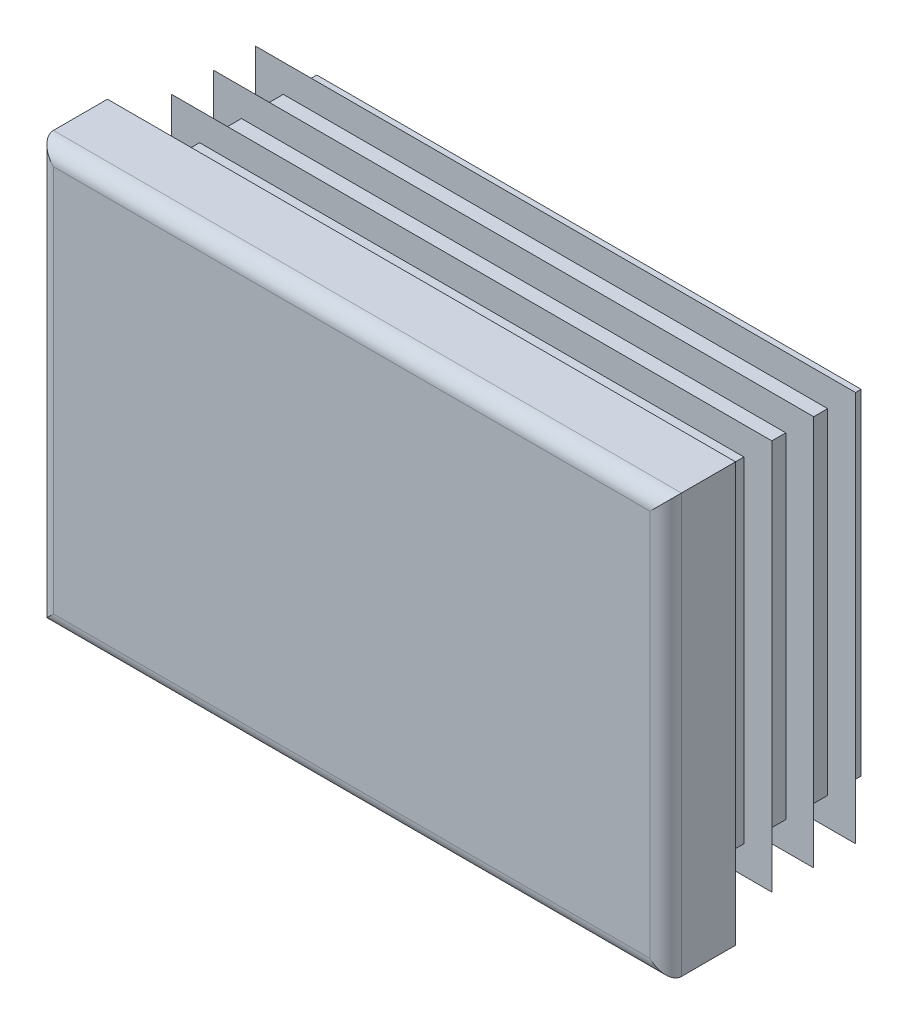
ISO-10303-21;
HEADER;
FILE_DESCRIPTION(('STEP AP214'),'2;1');
FILE_NAME('part.step','',(''),(''),'','','');
FILE_SCHEMA(('AUTOMOTIVE_DESIGN { 1 0 10303 214 1 1 1 1 }'));
ENDSEC;
DATA;
#1=APPLICATION_CONTEXT('core data for automotive mechanical design processes');
#2=APPLICATION_PROTOCOL_DEFINITION('international standard','automotive_design',2000,#1);
#3=PRODUCT_CONTEXT('',#1,'mechanical');
#4=PRODUCT('Part','Part','',(#3));
#5=PRODUCT_RELATED_PRODUCT_CATEGORY('part','',(#4));
#6=PRODUCT_DEFINITION_FORMATION('','',#4);
#7=PRODUCT_DEFINITION_CONTEXT('part definition',#1,'design');
#8=PRODUCT_DEFINITION('design','',#6,#7);
#9=PRODUCT_DEFINITION_SHAPE('','',#8);
#10=(LENGTH_UNIT() NAMED_UNIT(*) SI_UNIT(.MILLI.,.METRE.));
#11=(NAMED_UNIT(*) PLANE_ANGLE_UNIT() SI_UNIT($,.RADIAN.));
#12=(NAMED_UNIT(*) SI_UNIT($,.STERADIAN.) SOLID_ANGLE_UNIT());
#13=UNCERTAINTY_MEASURE_WITH_UNIT(LENGTH_MEASURE(1.E-05),#10,'distance_accuracy_value','');
#14=(GEOMETRIC_REPRESENTATION_CONTEXT(3) GLOBAL_UNCERTAINTY_ASSIGNED_CONTEXT((#13)) GLOBAL_UNIT_ASSIGNED_CONTEXT((#10,
#11,#12)) REPRESENTATION_CONTEXT('',''));
#15=CARTESIAN_POINT('',(0.,0.,0.));
#16=DIRECTION('',(0.,0.,1.));
#17=DIRECTION('',(1.,0.,0.));
#18=AXIS2_PLACEMENT_3D('',#15,#16,#17);
#19=CARTESIAN_POINT('',(21.375,-15.,5.));
#20=DIRECTION('',(0.,0.,-1.));
#21=DIRECTION('',(0.,1.,0.));
#22=AXIS2_PLACEMENT_3D('',#19,#20,#21);
#23=PLANE('',#22);
#24=DIRECTION('',(0.,1.,0.));
#25=VECTOR('',#24,1.);
#26=CARTESIAN_POINT('',(-21.375,-15.,5.));
#27=LINE('',#26,#25);
#28=CARTESIAN_POINT('',(-21.375,-13.875,5.));
#29=VERTEX_POINT('',#28);
#30=CARTESIAN_POINT('',(-21.375,13.875,5.));
#31=VERTEX_POINT('',#30);
#32=EDGE_CURVE('E310',#29,#31,#27,.T.);
#33=ORIENTED_EDGE('',*,*,#32,.F.);
#34=DIRECTION('',(-1.,0.,0.));
#35=VECTOR('',#34,1.);
#36=CARTESIAN_POINT('',(22.5,-13.875,5.));
#37=LINE('',#36,#35);
#38=CARTESIAN_POINT('',(21.375,-13.875,5.));
#39=VERTEX_POINT('',#38);
#40=EDGE_CURVE('E482',#39,#29,#37,.T.);
#41=ORIENTED_EDGE('',*,*,#40,.F.);
#42=DIRECTION('',(0.,1.,0.));
#43=VECTOR('',#42,1.);
#44=CARTESIAN_POINT('',(21.375,-15.,5.));
#45=LINE('',#44,#43);
#46=CARTESIAN_POINT('',(21.375,13.875,5.));
#47=VERTEX_POINT('',#46);
#48=EDGE_CURVE('E305',#39,#47,#45,.T.);
#49=ORIENTED_EDGE('',*,*,#48,.T.);
#50=DIRECTION('',(-1.,0.,0.));
#51=VECTOR('',#50,1.);
#52=CARTESIAN_POINT('',(22.5,13.875,5.));
#53=LINE('',#52,#51);
#54=EDGE_CURVE('E630',#47,#31,#53,.T.);
#55=ORIENTED_EDGE('',*,*,#54,.T.);
#56=EDGE_LOOP('',(#33,#41,#49,#55));
#57=FACE_BOUND('',#56,.T.);
#58=ADVANCED_FACE('F14',(#57),#23,.F.);
#59=CARTESIAN_POINT('',(-21.375,-15.,3.875));
#60=DIRECTION('',(0.,1.,0.));
#61=DIRECTION('',(-1.,0.,0.));
#62=AXIS2_PLACEMENT_3D('',#59,#60,#61);
#63=CYLINDRICAL_SURFACE('',#62,1.125);
#64=DIRECTION('',(0.,1.,0.));
#65=VECTOR('',#64,1.);
#66=CARTESIAN_POINT('',(-22.5,-15.,3.875));
#67=LINE('',#66,#65);
#68=CARTESIAN_POINT('',(-22.5,-15.,3.875));
#69=VERTEX_POINT('',#68);
#70=CARTESIAN_POINT('',(-22.5,15.,3.875));
#71=VERTEX_POINT('',#70);
#72=EDGE_CURVE('E402',#69,#71,#67,.T.);
#73=ORIENTED_EDGE('',*,*,#72,.F.);
#74=CARTESIAN_POINT('',(-21.375,-13.875,3.875));
#75=DIRECTION('',(-0.707106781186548,0.707106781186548,0.));
#76=DIRECTION('',(0.707106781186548,0.707106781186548,0.));
#77=AXIS2_PLACEMENT_3D('',#74,#75,#76);
#78=ELLIPSE('',#77,1.59099025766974,1.125);
#79=EDGE_CURVE('E59',#69,#29,#78,.T.);
#80=ORIENTED_EDGE('',*,*,#79,.T.);
#81=ORIENTED_EDGE('',*,*,#32,.T.);
#82=CARTESIAN_POINT('',(-21.375,13.875,3.875));
#83=DIRECTION('',(0.707106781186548,0.707106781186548,0.));
#84=DIRECTION('',(-0.707106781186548,0.707106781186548,0.));
#85=AXIS2_PLACEMENT_3D('',#82,#83,#84);
#86=ELLIPSE('',#85,1.59099025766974,1.125);
#87=EDGE_CURVE('E306',#31,#71,#86,.F.);
#88=ORIENTED_EDGE('',*,*,#87,.T.);
#89=EDGE_LOOP('',(#73,#80,#81,#88));
#90=FACE_BOUND('',#89,.T.);
#91=ADVANCED_FACE('F16',(#90),#63,.T.);
#92=CARTESIAN_POINT('',(-22.5,-15.,3.875));
#93=DIRECTION('',(1.,0.,0.));
#94=DIRECTION('',(0.,1.,0.));
#95=AXIS2_PLACEMENT_3D('',#92,#93,#94);
#96=PLANE('',#95);
#97=DIRECTION('',(0.,0.,-1.));
#98=VECTOR('',#97,1.);
#99=CARTESIAN_POINT('',(-22.5,15.,3.875));
#100=LINE('',#99,#98);
#101=CARTESIAN_POINT('',(-22.5,15.,0.));
#102=VERTEX_POINT('',#101);
#103=EDGE_CURVE('E615',#71,#102,#100,.T.);
#104=ORIENTED_EDGE('',*,*,#103,.T.);
#105=DIRECTION('',(0.,1.,0.));
#106=VECTOR('',#105,1.);
#107=CARTESIAN_POINT('',(-22.5,-15.,0.));
#108=LINE('',#107,#106);
#109=CARTESIAN_POINT('',(-22.5,-15.,0.));
#110=VERTEX_POINT('',#109);
#111=EDGE_CURVE('E400',#110,#102,#108,.T.);
#112=ORIENTED_EDGE('',*,*,#111,.F.);
#113=DIRECTION('',(0.,0.,-1.));
#114=VECTOR('',#113,1.);
#115=CARTESIAN_POINT('',(-22.5,-15.,3.875));
#116=LINE('',#115,#114);
#117=EDGE_CURVE('E616',#69,#110,#116,.T.);
#118=ORIENTED_EDGE('',*,*,#117,.F.);
#119=ORIENTED_EDGE('',*,*,#72,.T.);
#120=EDGE_LOOP('',(#104,#112,#118,#119));
#121=FACE_BOUND('',#120,.T.);
#122=ADVANCED_FACE('F697',(#121),#96,.F.);
#123=CARTESIAN_POINT('',(-19.5,-15.,0.));
#124=DIRECTION('',(1.,0.,0.));
#125=DIRECTION('',(0.,1.,0.));
#126=AXIS2_PLACEMENT_3D('',#123,#124,#125);
#127=PLANE('',#126);
#128=DIRECTION('',(0.,1.,0.));
#129=VECTOR('',#128,1.);
#130=CARTESIAN_POINT('',(-19.5,-15.,0.));
#131=LINE('',#130,#129);
#132=CARTESIAN_POINT('',(-19.5,-12.,0.));
#133=VERTEX_POINT('',#132);
#134=CARTESIAN_POINT('',(-19.5,12.,0.));
#135=VERTEX_POINT('',#134);
#136=EDGE_CURVE('E397',#133,#135,#131,.T.);
#137=ORIENTED_EDGE('',*,*,#136,.T.);
#138=DIRECTION('',(0.,0.,-1.));
#139=VECTOR('',#138,1.);
#140=CARTESIAN_POINT('',(-19.5,12.,0.));
#141=LINE('',#140,#139);
#142=CARTESIAN_POINT('',(-19.5,12.,-0.6));
#143=VERTEX_POINT('',#142);
#144=EDGE_CURVE('E495',#135,#143,#141,.T.);
#145=ORIENTED_EDGE('',*,*,#144,.T.);
#146=DIRECTION('',(0.,1.,0.));
#147=VECTOR('',#146,1.);
#148=CARTESIAN_POINT('',(-19.5,-15.,-0.6));
#149=LINE('',#148,#147);
#150=CARTESIAN_POINT('',(-19.5,-12.,-0.6));
#151=VERTEX_POINT('',#150);
#152=EDGE_CURVE('E394',#151,#143,#149,.T.);
#153=ORIENTED_EDGE('',*,*,#152,.F.);
#154=DIRECTION('',(0.,0.,1.));
#155=VECTOR('',#154,1.);
#156=CARTESIAN_POINT('',(-19.5,-12.,0.));
#157=LINE('',#156,#155);
#158=EDGE_CURVE('E489',#151,#133,#157,.T.);
#159=ORIENTED_EDGE('',*,*,#158,.T.);
#160=EDGE_LOOP('',(#137,#145,#153,#159));
#161=FACE_BOUND('',#160,.T.);
#162=ADVANCED_FACE('F787',(#161),#127,.F.);
#163=CARTESIAN_POINT('',(-21.5,-15.,-0.6));
#164=DIRECTION('',(0.342020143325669,0.,0.939692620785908));
#165=DIRECTION('',(-0.939692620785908,0.,0.342020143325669));
#166=AXIS2_PLACEMENT_3D('',#163,#164,#165);
#167=PLANE('',#166);
#168=DIRECTION('',(0.,1.,0.));
#169=VECTOR('',#168,1.);
#170=CARTESIAN_POINT('',(-21.5,-15.,-0.6));
#171=LINE('',#170,#169);
#172=CARTESIAN_POINT('',(-21.5,-14.,-0.6));
#173=VERTEX_POINT('',#172);
#174=CARTESIAN_POINT('',(-21.5,14.,-0.6));
#175=VERTEX_POINT('',#174);
#176=EDGE_CURVE('E392',#173,#175,#171,.T.);
#177=ORIENTED_EDGE('',*,*,#176,.T.);
#178=DIRECTION('',(0.844349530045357,-0.438895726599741,-0.307318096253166));
#179=VECTOR('',#178,1.);
#180=CARTESIAN_POINT('',(-10.7531393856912,8.41374569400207,-4.5115373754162));
#181=LINE('',#180,#179);
#182=CARTESIAN_POINT('',(-19.5,12.9603932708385,-1.3279404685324));
#183=VERTEX_POINT('',#182);
#184=EDGE_CURVE('E519',#175,#183,#181,.T.);
#185=ORIENTED_EDGE('',*,*,#184,.T.);
#186=DIRECTION('',(0.,1.,0.));
#187=VECTOR('',#186,1.);
#188=CARTESIAN_POINT('',(-19.5,-15.,-1.3279404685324));
#189=LINE('',#188,#187);
#190=CARTESIAN_POINT('',(-19.5,-12.9603932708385,-1.3279404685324));
#191=VERTEX_POINT('',#190);
#192=EDGE_CURVE('E389',#191,#183,#189,.T.);
#193=ORIENTED_EDGE('',*,*,#192,.F.);
#194=DIRECTION('',(-0.844349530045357,-0.438895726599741,0.307318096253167));
#195=VECTOR('',#194,1.);
#196=CARTESIAN_POINT('',(-21.8705814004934,-14.1926294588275,-0.465119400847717));
#197=LINE('',#196,#195);
#198=EDGE_CURVE('E507',#191,#173,#197,.T.);
#199=ORIENTED_EDGE('',*,*,#198,.T.);
#200=EDGE_LOOP('',(#177,#185,#193,#199));
#201=FACE_BOUND('',#200,.T.);
#202=ADVANCED_FACE('F783',(#201),#167,.F.);
#203=CARTESIAN_POINT('',(-19.5,-15.,-1.3279404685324));
#204=DIRECTION('',(1.,0.,0.));
#205=DIRECTION('',(0.,1.,0.));
#206=AXIS2_PLACEMENT_3D('',#203,#204,#205);
#207=PLANE('',#206);
#208=ORIENTED_EDGE('',*,*,#192,.T.);
#209=DIRECTION('',(0.,-0.819152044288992,-0.573576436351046));
#210=VECTOR('',#209,1.);
#211=CARTESIAN_POINT('',(-19.5,-5.80131222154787,-14.4650280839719));
#212=LINE('',#211,#210);
#213=CARTESIAN_POINT('',(-19.5,12.,-2.00041507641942));
#214=VERTEX_POINT('',#213);
#215=EDGE_CURVE('E516',#183,#214,#212,.T.);
#216=ORIENTED_EDGE('',*,*,#215,.T.);
#217=DIRECTION('',(0.,0.,-1.));
#218=VECTOR('',#217,1.);
#219=CARTESIAN_POINT('',(-19.5,12.,-1.3279404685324));
#220=LINE('',#219,#218);
#221=CARTESIAN_POINT('',(-19.5,12.,-3.6));
#222=VERTEX_POINT('',#221);
#223=EDGE_CURVE('E525',#214,#222,#220,.T.);
#224=ORIENTED_EDGE('',*,*,#223,.T.);
#225=DIRECTION('',(0.,1.,0.));
#226=VECTOR('',#225,1.);
#227=CARTESIAN_POINT('',(-19.5,-15.,-3.6));
#228=LINE('',#227,#226);
#229=CARTESIAN_POINT('',(-19.5,-12.,-3.6));
#230=VERTEX_POINT('',#229);
#231=EDGE_CURVE('E386',#230,#222,#228,.T.);
#232=ORIENTED_EDGE('',*,*,#231,.F.);
#233=DIRECTION('',(0.,0.,1.));
#234=VECTOR('',#233,1.);
#235=CARTESIAN_POINT('',(-19.5,-12.,-1.3279404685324));
#236=LINE('',#235,#234);
#237=CARTESIAN_POINT('',(-19.5,-12.,-2.00041507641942));
#238=VERTEX_POINT('',#237);
#239=EDGE_CURVE('E522',#230,#238,#236,.T.);
#240=ORIENTED_EDGE('',*,*,#239,.T.);
#241=DIRECTION('',(0.,-0.819152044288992,0.573576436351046));
#242=VECTOR('',#241,1.);
#243=CARTESIAN_POINT('',(-19.5,-14.3289899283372,-0.369638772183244));
#244=LINE('',#243,#242);
#245=EDGE_CURVE('E504',#238,#191,#244,.T.);
#246=ORIENTED_EDGE('',*,*,#245,.T.);
#247=EDGE_LOOP('',(#208,#216,#224,#232,#240,#246));
#248=FACE_BOUND('',#247,.T.);
#249=ADVANCED_FACE('F779',(#248),#207,.F.);
#250=CARTESIAN_POINT('',(-21.5,-15.,-3.6));
#251=DIRECTION('',(0.342020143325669,0.,0.939692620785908));
#252=DIRECTION('',(-0.939692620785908,0.,0.342020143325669));
#253=AXIS2_PLACEMENT_3D('',#250,#251,#252);
#254=PLANE('',#253);
#255=DIRECTION('',(0.,1.,0.));
#256=VECTOR('',#255,1.);
#257=CARTESIAN_POINT('',(-21.5,-15.,-3.6));
#258=LINE('',#257,#256);
#259=CARTESIAN_POINT('',(-21.5,-14.,-3.6));
#260=VERTEX_POINT('',#259);
#261=CARTESIAN_POINT('',(-21.5,14.,-3.6));
#262=VERTEX_POINT('',#261);
#263=EDGE_CURVE('E384',#260,#262,#258,.T.);
#264=ORIENTED_EDGE('',*,*,#263,.T.);
#265=DIRECTION('',(0.844349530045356,-0.438895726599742,-0.307318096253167));
#266=VECTOR('',#265,1.);
#267=CARTESIAN_POINT('',(-10.7531393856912,8.41374569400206,-7.51153737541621));
#268=LINE('',#267,#266);
#269=CARTESIAN_POINT('',(-19.5,12.9603932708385,-4.3279404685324));
#270=VERTEX_POINT('',#269);
#271=EDGE_CURVE('E549',#262,#270,#268,.T.);
#272=ORIENTED_EDGE('',*,*,#271,.T.);
#273=DIRECTION('',(0.,1.,0.));
#274=VECTOR('',#273,1.);
#275=CARTESIAN_POINT('',(-19.5,-15.,-4.3279404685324));
#276=LINE('',#275,#274);
#277=CARTESIAN_POINT('',(-19.5,-12.9603932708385,-4.3279404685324));
#278=VERTEX_POINT('',#277);
#279=EDGE_CURVE('E381',#278,#270,#276,.T.);
#280=ORIENTED_EDGE('',*,*,#279,.F.);
#281=DIRECTION('',(-0.844349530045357,-0.438895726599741,0.307318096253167));
#282=VECTOR('',#281,1.);
#283=CARTESIAN_POINT('',(-21.8705814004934,-14.1926294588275,-3.46511940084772));
#284=LINE('',#283,#282);
#285=EDGE_CURVE('E537',#278,#260,#284,.T.);
#286=ORIENTED_EDGE('',*,*,#285,.T.);
#287=EDGE_LOOP('',(#264,#272,#280,#286));
#288=FACE_BOUND('',#287,.T.);
#289=ADVANCED_FACE('F775',(#288),#254,.F.);
#290=CARTESIAN_POINT('',(-19.5,-15.,-4.3279404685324));
#291=DIRECTION('',(1.,0.,0.));
#292=DIRECTION('',(0.,1.,0.));
#293=AXIS2_PLACEMENT_3D('',#290,#291,#292);
#294=PLANE('',#293);
#295=ORIENTED_EDGE('',*,*,#279,.T.);
#296=DIRECTION('',(0.,-0.819152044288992,-0.573576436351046));
#297=VECTOR('',#296,1.);
#298=CARTESIAN_POINT('',(-19.5,-5.80131222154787,-17.4650280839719));
#299=LINE('',#298,#297);
#300=CARTESIAN_POINT('',(-19.5,12.,-5.00041507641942));
#301=VERTEX_POINT('',#300);
#302=EDGE_CURVE('E546',#270,#301,#299,.T.);
#303=ORIENTED_EDGE('',*,*,#302,.T.);
#304=DIRECTION('',(0.,0.,-1.));
#305=VECTOR('',#304,1.);
#306=CARTESIAN_POINT('',(-19.5,12.,-4.3279404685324));
#307=LINE('',#306,#305);
#308=CARTESIAN_POINT('',(-19.5,12.,-6.6));
#309=VERTEX_POINT('',#308);
#310=EDGE_CURVE('E555',#301,#309,#307,.T.);
#311=ORIENTED_EDGE('',*,*,#310,.T.);
#312=DIRECTION('',(0.,1.,0.));
#313=VECTOR('',#312,1.);
#314=CARTESIAN_POINT('',(-19.5,-15.,-6.6));
#315=LINE('',#314,#313);
#316=CARTESIAN_POINT('',(-19.5,-12.,-6.6));
#317=VERTEX_POINT('',#316);
#318=EDGE_CURVE('E378',#317,#309,#315,.T.);
#319=ORIENTED_EDGE('',*,*,#318,.F.);
#320=DIRECTION('',(0.,0.,1.));
#321=VECTOR('',#320,1.);
#322=CARTESIAN_POINT('',(-19.5,-12.,-4.3279404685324));
#323=LINE('',#322,#321);
#324=CARTESIAN_POINT('',(-19.5,-12.,-5.00041507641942));
#325=VERTEX_POINT('',#324);
#326=EDGE_CURVE('E552',#317,#325,#323,.T.);
#327=ORIENTED_EDGE('',*,*,#326,.T.);
#328=DIRECTION('',(0.,-0.819152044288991,0.573576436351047));
#329=VECTOR('',#328,1.);
#330=CARTESIAN_POINT('',(-19.5,-14.3289899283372,-3.36963877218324));
#331=LINE('',#330,#329);
#332=EDGE_CURVE('E534',#325,#278,#331,.T.);
#333=ORIENTED_EDGE('',*,*,#332,.T.);
#334=EDGE_LOOP('',(#295,#303,#311,#319,#327,#333));
#335=FACE_BOUND('',#334,.T.);
#336=ADVANCED_FACE('F771',(#335),#294,.F.);
#337=CARTESIAN_POINT('',(-21.5,-15.,-6.6));
#338=DIRECTION('',(0.342020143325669,0.,0.939692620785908));
#339=DIRECTION('',(-0.939692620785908,0.,0.342020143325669));
#340=AXIS2_PLACEMENT_3D('',#337,#338,#339);
#341=PLANE('',#340);
#342=DIRECTION('',(0.,1.,0.));
#343=VECTOR('',#342,1.);
#344=CARTESIAN_POINT('',(-21.5,-15.,-6.6));
#345=LINE('',#344,#343);
#346=CARTESIAN_POINT('',(-21.5,-14.,-6.6));
#347=VERTEX_POINT('',#346);
#348=CARTESIAN_POINT('',(-21.5,14.,-6.6));
#349=VERTEX_POINT('',#348);
#350=EDGE_CURVE('E376',#347,#349,#345,.T.);
#351=ORIENTED_EDGE('',*,*,#350,.T.);
#352=DIRECTION('',(0.844349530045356,-0.438895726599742,-0.307318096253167));
#353=VECTOR('',#352,1.);
#354=CARTESIAN_POINT('',(-10.7531393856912,8.41374569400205,-10.5115373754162));
#355=LINE('',#354,#353);
#356=CARTESIAN_POINT('',(-19.5,12.9603932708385,-7.3279404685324));
#357=VERTEX_POINT('',#356);
#358=EDGE_CURVE('E579',#349,#357,#355,.T.);
#359=ORIENTED_EDGE('',*,*,#358,.T.);
#360=DIRECTION('',(0.,1.,0.));
#361=VECTOR('',#360,1.);
#362=CARTESIAN_POINT('',(-19.5,-15.,-7.3279404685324));
#363=LINE('',#362,#361);
#364=CARTESIAN_POINT('',(-19.5,-12.9603932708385,-7.3279404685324));
#365=VERTEX_POINT('',#364);
#366=EDGE_CURVE('E373',#365,#357,#363,.T.);
#367=ORIENTED_EDGE('',*,*,#366,.F.);
#368=DIRECTION('',(-0.844349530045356,-0.438895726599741,0.307318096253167));
#369=VECTOR('',#368,1.);
#370=CARTESIAN_POINT('',(-21.8705814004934,-14.1926294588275,-6.46511940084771));
#371=LINE('',#370,#369);
#372=EDGE_CURVE('E567',#365,#347,#371,.T.);
#373=ORIENTED_EDGE('',*,*,#372,.T.);
#374=EDGE_LOOP('',(#351,#359,#367,#373));
#375=FACE_BOUND('',#374,.T.);
#376=ADVANCED_FACE('F767',(#375),#341,.F.);
#377=CARTESIAN_POINT('',(-19.5,-15.,-7.3279404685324));
#378=DIRECTION('',(1.,0.,0.));
#379=DIRECTION('',(0.,1.,0.));
#380=AXIS2_PLACEMENT_3D('',#377,#378,#379);
#381=PLANE('',#380);
#382=ORIENTED_EDGE('',*,*,#366,.T.);
#383=DIRECTION('',(0.,-0.819152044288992,-0.573576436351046));
#384=VECTOR('',#383,1.);
#385=CARTESIAN_POINT('',(-19.5,-5.80131222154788,-20.4650280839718));
#386=LINE('',#385,#384);
#387=CARTESIAN_POINT('',(-19.5,12.,-8.00041507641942));
#388=VERTEX_POINT('',#387);
#389=EDGE_CURVE('E576',#357,#388,#386,.T.);
#390=ORIENTED_EDGE('',*,*,#389,.T.);
#391=DIRECTION('',(0.,0.,-1.));
#392=VECTOR('',#391,1.);
#393=CARTESIAN_POINT('',(-19.5,12.,-7.3279404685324));
#394=LINE('',#393,#392);
#395=CARTESIAN_POINT('',(-19.5,12.,-9.6));
#396=VERTEX_POINT('',#395);
#397=EDGE_CURVE('E585',#388,#396,#394,.T.);
#398=ORIENTED_EDGE('',*,*,#397,.T.);
#399=DIRECTION('',(0.,1.,0.));
#400=VECTOR('',#399,1.);
#401=CARTESIAN_POINT('',(-19.5,-15.,-9.6));
#402=LINE('',#401,#400);
#403=CARTESIAN_POINT('',(-19.5,-12.,-9.6));
#404=VERTEX_POINT('',#403);
#405=EDGE_CURVE('E370',#404,#396,#402,.T.);
#406=ORIENTED_EDGE('',*,*,#405,.F.);
#407=DIRECTION('',(0.,0.,1.));
#408=VECTOR('',#407,1.);
#409=CARTESIAN_POINT('',(-19.5,-12.,-7.3279404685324));
#410=LINE('',#409,#408);
#411=CARTESIAN_POINT('',(-19.5,-12.,-8.00041507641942));
#412=VERTEX_POINT('',#411);
#413=EDGE_CURVE('E582',#404,#412,#410,.T.);
#414=ORIENTED_EDGE('',*,*,#413,.T.);
#415=DIRECTION('',(0.,-0.819152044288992,0.573576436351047));
#416=VECTOR('',#415,1.);
#417=CARTESIAN_POINT('',(-19.5,-14.3289899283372,-6.36963877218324));
#418=LINE('',#417,#416);
#419=EDGE_CURVE('E564',#412,#365,#418,.T.);
#420=ORIENTED_EDGE('',*,*,#419,.T.);
#421=EDGE_LOOP('',(#382,#390,#398,#406,#414,#420));
#422=FACE_BOUND('',#421,.T.);
#423=ADVANCED_FACE('F764',(#422),#381,.F.);
#424=CARTESIAN_POINT('',(-21.5,-15.,-9.6));
#425=DIRECTION('',(0.342020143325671,0.,0.939692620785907));
#426=DIRECTION('',(-0.939692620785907,0.,0.342020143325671));
#427=AXIS2_PLACEMENT_3D('',#424,#425,#426);
#428=PLANE('',#427);
#429=DIRECTION('',(0.,1.,0.));
#430=VECTOR('',#429,1.);
#431=CARTESIAN_POINT('',(-21.5,-15.,-9.6));
#432=LINE('',#431,#430);
#433=CARTESIAN_POINT('',(-21.5,-14.,-9.6));
#434=VERTEX_POINT('',#433);
#435=CARTESIAN_POINT('',(-21.5,14.,-9.6));
#436=VERTEX_POINT('',#435);
#437=EDGE_CURVE('E368',#434,#436,#432,.T.);
#438=ORIENTED_EDGE('',*,*,#437,.T.);
#439=DIRECTION('',(0.844349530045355,-0.438895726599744,-0.307318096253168));
#440=VECTOR('',#439,1.);
#441=CARTESIAN_POINT('',(-10.7531393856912,8.41374569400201,-13.5115373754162));
#442=LINE('',#441,#440);
#443=CARTESIAN_POINT('',(-19.5,12.9603932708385,-10.3279404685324));
#444=VERTEX_POINT('',#443);
#445=EDGE_CURVE('E607',#436,#444,#442,.T.);
#446=ORIENTED_EDGE('',*,*,#445,.T.);
#447=DIRECTION('',(0.,1.,0.));
#448=VECTOR('',#447,1.);
#449=CARTESIAN_POINT('',(-19.5,-15.,-10.3279404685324));
#450=LINE('',#449,#448);
#451=CARTESIAN_POINT('',(-19.5,-12.9603932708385,-10.3279404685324));
#452=VERTEX_POINT('',#451);
#453=EDGE_CURVE('E365',#452,#444,#450,.T.);
#454=ORIENTED_EDGE('',*,*,#453,.F.);
#455=DIRECTION('',(-0.844349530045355,-0.438895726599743,0.307318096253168));
#456=VECTOR('',#455,1.);
#457=CARTESIAN_POINT('',(-21.8705814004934,-14.1926294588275,-9.46511940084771));
#458=LINE('',#457,#456);
#459=EDGE_CURVE('E595',#452,#434,#458,.T.);
#460=ORIENTED_EDGE('',*,*,#459,.T.);
#461=EDGE_LOOP('',(#438,#446,#454,#460));
#462=FACE_BOUND('',#461,.T.);
#463=ADVANCED_FACE('F675',(#462),#428,.F.);
#464=CARTESIAN_POINT('',(-19.5,-15.,-10.3279404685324));
#465=DIRECTION('',(1.,0.,0.));
#466=DIRECTION('',(0.,1.,0.));
#467=AXIS2_PLACEMENT_3D('',#464,#465,#466);
#468=PLANE('',#467);
#469=ORIENTED_EDGE('',*,*,#453,.T.);
#470=DIRECTION('',(0.,-0.819152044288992,-0.573576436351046));
#471=VECTOR('',#470,1.);
#472=CARTESIAN_POINT('',(-19.5,-5.80131222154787,-23.4650280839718));
#473=LINE('',#472,#471);
#474=CARTESIAN_POINT('',(-19.5,12.,-11.0004150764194));
#475=VERTEX_POINT('',#474);
#476=EDGE_CURVE('E604',#444,#475,#473,.T.);
#477=ORIENTED_EDGE('',*,*,#476,.T.);
#478=DIRECTION('',(0.,0.,-1.));
#479=VECTOR('',#478,1.);
#480=CARTESIAN_POINT('',(-19.5,12.,-10.3279404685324));
#481=LINE('',#480,#479);
#482=CARTESIAN_POINT('',(-19.5,12.,-12.));
#483=VERTEX_POINT('',#482);
#484=EDGE_CURVE('E613',#475,#483,#481,.T.);
#485=ORIENTED_EDGE('',*,*,#484,.T.);
#486=DIRECTION('',(0.,1.,0.));
#487=VECTOR('',#486,1.);
#488=CARTESIAN_POINT('',(-19.5,-15.,-12.));
#489=LINE('',#488,#487);
#490=CARTESIAN_POINT('',(-19.5,-12.,-12.));
#491=VERTEX_POINT('',#490);
#492=EDGE_CURVE('E362',#491,#483,#489,.T.);
#493=ORIENTED_EDGE('',*,*,#492,.F.);
#494=DIRECTION('',(0.,0.,1.));
#495=VECTOR('',#494,1.);
#496=CARTESIAN_POINT('',(-19.5,-12.,-10.3279404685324));
#497=LINE('',#496,#495);
#498=CARTESIAN_POINT('',(-19.5,-12.,-11.0004150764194));
#499=VERTEX_POINT('',#498);
#500=EDGE_CURVE('E610',#491,#499,#497,.T.);
#501=ORIENTED_EDGE('',*,*,#500,.T.);
#502=DIRECTION('',(0.,-0.819152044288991,0.573576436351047));
#503=VECTOR('',#502,1.);
#504=CARTESIAN_POINT('',(-19.5,-14.3289899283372,-9.36963877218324));
#505=LINE('',#504,#503);
#506=EDGE_CURVE('E592',#499,#452,#505,.T.);
#507=ORIENTED_EDGE('',*,*,#506,.T.);
#508=EDGE_LOOP('',(#469,#477,#485,#493,#501,#507));
#509=FACE_BOUND('',#508,.T.);
#510=ADVANCED_FACE('F677',(#509),#468,.F.);
#511=CARTESIAN_POINT('',(-19.5,-15.,-12.));
#512=DIRECTION('',(0.,0.,1.));
#513=DIRECTION('',(0.,-1.,0.));
#514=AXIS2_PLACEMENT_3D('',#511,#512,#513);
#515=PLANE('',#514);
#516=ORIENTED_EDGE('',*,*,#492,.T.);
#517=DIRECTION('',(-1.,0.,0.));
#518=VECTOR('',#517,1.);
#519=CARTESIAN_POINT('',(22.5,12.,-12.));
#520=LINE('',#519,#518);
#521=CARTESIAN_POINT('',(19.5,12.,-12.));
#522=VERTEX_POINT('',#521);
#523=EDGE_CURVE('E438',#522,#483,#520,.T.);
#524=ORIENTED_EDGE('',*,*,#523,.F.);
#525=DIRECTION('',(0.,1.,0.));
#526=VECTOR('',#525,1.);
#527=CARTESIAN_POINT('',(19.5,-15.,-12.));
#528=LINE('',#527,#526);
#529=CARTESIAN_POINT('',(19.5,-12.,-12.));
#530=VERTEX_POINT('',#529);
#531=EDGE_CURVE('E359',#530,#522,#528,.T.);
#532=ORIENTED_EDGE('',*,*,#531,.F.);
#533=DIRECTION('',(-1.,0.,0.));
#534=VECTOR('',#533,1.);
#535=CARTESIAN_POINT('',(22.5,-12.,-12.));
#536=LINE('',#535,#534);
#537=EDGE_CURVE('E436',#530,#491,#536,.T.);
#538=ORIENTED_EDGE('',*,*,#537,.T.);
#539=EDGE_LOOP('',(#516,#524,#532,#538));
#540=FACE_BOUND('',#539,.T.);
#541=ADVANCED_FACE('F435',(#540),#515,.F.);
#542=CARTESIAN_POINT('',(19.5,-15.,-12.));
#543=DIRECTION('',(-1.,0.,0.));
#544=DIRECTION('',(0.,-1.,0.));
#545=AXIS2_PLACEMENT_3D('',#542,#543,#544);
#546=PLANE('',#545);
#547=DIRECTION('',(0.,0.,1.));
#548=VECTOR('',#547,1.);
#549=CARTESIAN_POINT('',(19.5,12.,-12.));
#550=LINE('',#549,#548);
#551=CARTESIAN_POINT('',(19.5,12.,-11.0004150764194));
#552=VERTEX_POINT('',#551);
#553=EDGE_CURVE('E9',#522,#552,#550,.T.);
#554=ORIENTED_EDGE('',*,*,#553,.T.);
#555=DIRECTION('',(0.,0.819152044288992,0.573576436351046));
#556=VECTOR('',#555,1.);
#557=CARTESIAN_POINT('',(19.5,-6.58692322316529,-24.0151188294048));
#558=LINE('',#557,#556);
#559=CARTESIAN_POINT('',(19.5,12.9603932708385,-10.3279404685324));
#560=VERTEX_POINT('',#559);
#561=EDGE_CURVE('E601',#552,#560,#558,.T.);
#562=ORIENTED_EDGE('',*,*,#561,.T.);
#563=DIRECTION('',(0.,1.,0.));
#564=VECTOR('',#563,1.);
#565=CARTESIAN_POINT('',(19.5,-15.,-10.3279404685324));
#566=LINE('',#565,#564);
#567=CARTESIAN_POINT('',(19.5,-12.9603932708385,-10.3279404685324));
#568=VERTEX_POINT('',#567);
#569=EDGE_CURVE('E356',#568,#560,#566,.T.);
#570=ORIENTED_EDGE('',*,*,#569,.F.);
#571=DIRECTION('',(0.,0.819152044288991,-0.573576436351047));
#572=VECTOR('',#571,1.);
#573=CARTESIAN_POINT('',(19.5,-13.5433789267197,-9.91972951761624));
#574=LINE('',#573,#572);
#575=CARTESIAN_POINT('',(19.5,-12.,-11.0004150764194));
#576=VERTEX_POINT('',#575);
#577=EDGE_CURVE('E428',#568,#576,#574,.T.);
#578=ORIENTED_EDGE('',*,*,#577,.T.);
#579=DIRECTION('',(0.,0.,-1.));
#580=VECTOR('',#579,1.);
#581=CARTESIAN_POINT('',(19.5,-12.,-12.));
#582=LINE('',#581,#580);
#583=EDGE_CURVE('E23',#576,#530,#582,.T.);
#584=ORIENTED_EDGE('',*,*,#583,.T.);
#585=ORIENTED_EDGE('',*,*,#531,.T.);
#586=EDGE_LOOP('',(#554,#562,#570,#578,#584,#585));
#587=FACE_BOUND('',#586,.T.);
#588=ADVANCED_FACE('F426',(#587),#546,.F.);
#589=CARTESIAN_POINT('',(19.5,-15.,-10.3279404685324));
#590=DIRECTION('',(-0.342020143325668,0.,0.939692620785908));
#591=DIRECTION('',(-0.939692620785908,0.,-0.342020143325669));
#592=AXIS2_PLACEMENT_3D('',#589,#590,#591);
#593=PLANE('',#592);
#594=ORIENTED_EDGE('',*,*,#569,.T.);
#595=DIRECTION('',(0.844349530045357,0.438895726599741,0.307318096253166));
#596=VECTOR('',#595,1.);
#597=CARTESIAN_POINT('',(9.13839830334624,7.57439784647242,-14.0992550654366));
#598=LINE('',#597,#596);
#599=CARTESIAN_POINT('',(21.5,14.,-9.6));
#600=VERTEX_POINT('',#599);
#601=EDGE_CURVE('E598',#560,#600,#598,.T.);
#602=ORIENTED_EDGE('',*,*,#601,.T.);
#603=DIRECTION('',(0.,1.,0.));
#604=VECTOR('',#603,1.);
#605=CARTESIAN_POINT('',(21.5,-15.,-9.6));
#606=LINE('',#605,#604);
#607=CARTESIAN_POINT('',(21.5,-14.,-9.6));
#608=VERTEX_POINT('',#607);
#609=EDGE_CURVE('E353',#608,#600,#606,.T.);
#610=ORIENTED_EDGE('',*,*,#609,.F.);
#611=DIRECTION('',(-0.844349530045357,0.43889572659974,-0.307318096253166));
#612=VECTOR('',#611,1.);
#613=CARTESIAN_POINT('',(20.2558403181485,-13.3532816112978,-10.0528370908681));
#614=LINE('',#613,#612);
#615=EDGE_CURVE('E588',#608,#568,#614,.T.);
#616=ORIENTED_EDGE('',*,*,#615,.T.);
#617=EDGE_LOOP('',(#594,#602,#610,#616));
#618=FACE_BOUND('',#617,.T.);
#619=ADVANCED_FACE('F752',(#618),#593,.F.);
#620=CARTESIAN_POINT('',(21.5,-15.,-9.6));
#621=DIRECTION('',(0.,0.,-1.));
#622=DIRECTION('',(0.,1.,0.));
#623=AXIS2_PLACEMENT_3D('',#620,#621,#622);
#624=PLANE('',#623);
#625=ORIENTED_EDGE('',*,*,#609,.T.);
#626=DIRECTION('',(-1.,0.,0.));
#627=VECTOR('',#626,1.);
#628=CARTESIAN_POINT('',(22.5,14.,-9.6));
#629=LINE('',#628,#627);
#630=EDGE_CURVE('E444',#600,#436,#629,.T.);
#631=ORIENTED_EDGE('',*,*,#630,.T.);
#632=ORIENTED_EDGE('',*,*,#437,.F.);
#633=DIRECTION('',(-1.,0.,0.));
#634=VECTOR('',#633,1.);
#635=CARTESIAN_POINT('',(22.5,-14.,-9.6));
#636=LINE('',#635,#634);
#637=EDGE_CURVE('E451',#608,#434,#636,.T.);
#638=ORIENTED_EDGE('',*,*,#637,.F.);
#639=EDGE_LOOP('',(#625,#631,#632,#638));
#640=FACE_BOUND('',#639,.T.);
#641=ORIENTED_EDGE('',*,*,#405,.T.);
#642=DIRECTION('',(-1.,0.,0.));
#643=VECTOR('',#642,1.);
#644=CARTESIAN_POINT('',(22.5,12.,-9.6));
#645=LINE('',#644,#643);
#646=CARTESIAN_POINT('',(19.5,12.,-9.6));
#647=VERTEX_POINT('',#646);
#648=EDGE_CURVE('E663',#647,#396,#645,.T.);
#649=ORIENTED_EDGE('',*,*,#648,.F.);
#650=DIRECTION('',(0.,1.,0.));
#651=VECTOR('',#650,1.);
#652=CARTESIAN_POINT('',(19.5,-15.,-9.6));
#653=LINE('',#652,#651);
#654=CARTESIAN_POINT('',(19.5,-12.,-9.6));
#655=VERTEX_POINT('',#654);
#656=EDGE_CURVE('E350',#655,#647,#653,.T.);
#657=ORIENTED_EDGE('',*,*,#656,.F.);
#658=DIRECTION('',(-1.,0.,0.));
#659=VECTOR('',#658,1.);
#660=CARTESIAN_POINT('',(22.5,-12.,-9.6));
#661=LINE('',#660,#659);
#662=EDGE_CURVE('E453',#655,#404,#661,.T.);
#663=ORIENTED_EDGE('',*,*,#662,.T.);
#664=EDGE_LOOP('',(#641,#649,#657,#663));
#665=FACE_BOUND('',#664,.T.);
#666=ADVANCED_FACE('F667',(#640,#665),#624,.F.);
#667=CARTESIAN_POINT('',(19.5,-15.,-9.6));
#668=DIRECTION('',(-1.,0.,0.));
#669=DIRECTION('',(0.,-1.,0.));
#670=AXIS2_PLACEMENT_3D('',#667,#668,#669);
#671=PLANE('',#670);
#672=DIRECTION('',(0.,0.,1.));
#673=VECTOR('',#672,1.);
#674=CARTESIAN_POINT('',(19.5,12.,-9.6));
#675=LINE('',#674,#673);
#676=CARTESIAN_POINT('',(19.5,12.,-8.00041507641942));
#677=VERTEX_POINT('',#676);
#678=EDGE_CURVE('E420',#647,#677,#675,.T.);
#679=ORIENTED_EDGE('',*,*,#678,.T.);
#680=DIRECTION('',(0.,0.819152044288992,0.573576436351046));
#681=VECTOR('',#680,1.);
#682=CARTESIAN_POINT('',(19.5,-6.86883100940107,-21.2125127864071));
#683=LINE('',#682,#681);
#684=CARTESIAN_POINT('',(19.5,12.9603932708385,-7.32794046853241));
#685=VERTEX_POINT('',#684);
#686=EDGE_CURVE('E573',#677,#685,#683,.T.);
#687=ORIENTED_EDGE('',*,*,#686,.T.);
#688=DIRECTION('',(0.,1.,0.));
#689=VECTOR('',#688,1.);
#690=CARTESIAN_POINT('',(19.5,-15.,-7.3279404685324));
#691=LINE('',#690,#689);
#692=CARTESIAN_POINT('',(19.5,-12.9603932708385,-7.3279404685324));
#693=VERTEX_POINT('',#692);
#694=EDGE_CURVE('E347',#693,#685,#691,.T.);
#695=ORIENTED_EDGE('',*,*,#694,.F.);
#696=DIRECTION('',(0.,0.819152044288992,-0.573576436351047));
#697=VECTOR('',#696,1.);
#698=CARTESIAN_POINT('',(19.5,-13.261471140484,-7.11712347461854));
#699=LINE('',#698,#697);
#700=CARTESIAN_POINT('',(19.5,-12.,-8.00041507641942));
#701=VERTEX_POINT('',#700);
#702=EDGE_CURVE('E561',#693,#701,#699,.T.);
#703=ORIENTED_EDGE('',*,*,#702,.T.);
#704=DIRECTION('',(0.,0.,-1.));
#705=VECTOR('',#704,1.);
#706=CARTESIAN_POINT('',(19.5,-12.,-9.6));
#707=LINE('',#706,#705);
#708=EDGE_CURVE('E417',#701,#655,#707,.T.);
#709=ORIENTED_EDGE('',*,*,#708,.T.);
#710=ORIENTED_EDGE('',*,*,#656,.T.);
#711=EDGE_LOOP('',(#679,#687,#695,#703,#709,#710));
#712=FACE_BOUND('',#711,.T.);
#713=ADVANCED_FACE('F745',(#712),#671,.F.);
#714=CARTESIAN_POINT('',(19.5,-15.,-7.3279404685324));
#715=DIRECTION('',(-0.342020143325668,0.,0.939692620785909));
#716=DIRECTION('',(-0.939692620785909,0.,-0.342020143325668));
#717=AXIS2_PLACEMENT_3D('',#714,#715,#716);
#718=PLANE('',#717);
#719=ORIENTED_EDGE('',*,*,#694,.T.);
#720=DIRECTION('',(0.844349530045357,0.43889572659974,0.307318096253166));
#721=VECTOR('',#720,1.);
#722=CARTESIAN_POINT('',(9.13839830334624,7.57439784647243,-11.0992550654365));
#723=LINE('',#722,#721);
#724=CARTESIAN_POINT('',(21.5,14.,-6.6));
#725=VERTEX_POINT('',#724);
#726=EDGE_CURVE('E570',#685,#725,#723,.T.);
#727=ORIENTED_EDGE('',*,*,#726,.T.);
#728=DIRECTION('',(0.,1.,0.));
#729=VECTOR('',#728,1.);
#730=CARTESIAN_POINT('',(21.5,-15.,-6.6));
#731=LINE('',#730,#729);
#732=CARTESIAN_POINT('',(21.5,-14.,-6.6));
#733=VERTEX_POINT('',#732);
#734=EDGE_CURVE('E344',#733,#725,#731,.T.);
#735=ORIENTED_EDGE('',*,*,#734,.F.);
#736=DIRECTION('',(-0.844349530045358,0.43889572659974,-0.307318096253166));
#737=VECTOR('',#736,1.);
#738=CARTESIAN_POINT('',(20.2558403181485,-13.3532816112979,-7.05283709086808));
#739=LINE('',#738,#737);
#740=EDGE_CURVE('E558',#733,#693,#739,.T.);
#741=ORIENTED_EDGE('',*,*,#740,.T.);
#742=EDGE_LOOP('',(#719,#727,#735,#741));
#743=FACE_BOUND('',#742,.T.);
#744=ADVANCED_FACE('F741',(#743),#718,.F.);
#745=CARTESIAN_POINT('',(21.5,-15.,-6.6));
#746=DIRECTION('',(0.,0.,-1.));
#747=DIRECTION('',(0.,1.,0.));
#748=AXIS2_PLACEMENT_3D('',#745,#746,#747);
#749=PLANE('',#748);
#750=ORIENTED_EDGE('',*,*,#734,.T.);
#751=DIRECTION('',(-1.,0.,0.));
#752=VECTOR('',#751,1.);
#753=CARTESIAN_POINT('',(22.5,14.,-6.6));
#754=LINE('',#753,#752);
#755=EDGE_CURVE('E657',#725,#349,#754,.T.);
#756=ORIENTED_EDGE('',*,*,#755,.T.);
#757=ORIENTED_EDGE('',*,*,#350,.F.);
#758=DIRECTION('',(-1.,0.,0.));
#759=VECTOR('',#758,1.);
#760=CARTESIAN_POINT('',(22.5,-14.,-6.6));
#761=LINE('',#760,#759);
#762=EDGE_CURVE('E459',#733,#347,#761,.T.);
#763=ORIENTED_EDGE('',*,*,#762,.F.);
#764=EDGE_LOOP('',(#750,#756,#757,#763));
#765=FACE_BOUND('',#764,.T.);
#766=ORIENTED_EDGE('',*,*,#318,.T.);
#767=DIRECTION('',(-1.,0.,0.));
#768=VECTOR('',#767,1.);
#769=CARTESIAN_POINT('',(22.5,12.,-6.6));
#770=LINE('',#769,#768);
#771=CARTESIAN_POINT('',(19.5,12.,-6.6));
#772=VERTEX_POINT('',#771);
#773=EDGE_CURVE('E655',#772,#309,#770,.T.);
#774=ORIENTED_EDGE('',*,*,#773,.F.);
#775=DIRECTION('',(0.,1.,0.));
#776=VECTOR('',#775,1.);
#777=CARTESIAN_POINT('',(19.5,-15.,-6.6));
#778=LINE('',#777,#776);
#779=CARTESIAN_POINT('',(19.5,-12.,-6.6));
#780=VERTEX_POINT('',#779);
#781=EDGE_CURVE('E341',#780,#772,#778,.T.);
#782=ORIENTED_EDGE('',*,*,#781,.F.);
#783=DIRECTION('',(-1.,0.,0.));
#784=VECTOR('',#783,1.);
#785=CARTESIAN_POINT('',(22.5,-12.,-6.6));
#786=LINE('',#785,#784);
#787=EDGE_CURVE('E461',#780,#317,#786,.T.);
#788=ORIENTED_EDGE('',*,*,#787,.T.);
#789=EDGE_LOOP('',(#766,#774,#782,#788));
#790=FACE_BOUND('',#789,.T.);
#791=ADVANCED_FACE('F737',(#765,#790),#749,.F.);
#792=CARTESIAN_POINT('',(19.5,-15.,-6.6));
#793=DIRECTION('',(-1.,0.,0.));
#794=DIRECTION('',(0.,-1.,0.));
#795=AXIS2_PLACEMENT_3D('',#792,#793,#794);
#796=PLANE('',#795);
#797=DIRECTION('',(0.,0.,1.));
#798=VECTOR('',#797,1.);
#799=CARTESIAN_POINT('',(19.5,12.,-6.6));
#800=LINE('',#799,#798);
#801=CARTESIAN_POINT('',(19.5,12.,-5.00041507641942));
#802=VERTEX_POINT('',#801);
#803=EDGE_CURVE('E414',#772,#802,#800,.T.);
#804=ORIENTED_EDGE('',*,*,#803,.T.);
#805=DIRECTION('',(0.,0.819152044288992,0.573576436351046));
#806=VECTOR('',#805,1.);
#807=CARTESIAN_POINT('',(19.5,-6.86883100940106,-18.2125127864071));
#808=LINE('',#807,#806);
#809=CARTESIAN_POINT('',(19.5,12.9603932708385,-4.3279404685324));
#810=VERTEX_POINT('',#809);
#811=EDGE_CURVE('E543',#802,#810,#808,.T.);
#812=ORIENTED_EDGE('',*,*,#811,.T.);
#813=DIRECTION('',(0.,1.,0.));
#814=VECTOR('',#813,1.);
#815=CARTESIAN_POINT('',(19.5,-15.,-4.3279404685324));
#816=LINE('',#815,#814);
#817=CARTESIAN_POINT('',(19.5,-12.9603932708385,-4.3279404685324));
#818=VERTEX_POINT('',#817);
#819=EDGE_CURVE('E338',#818,#810,#816,.T.);
#820=ORIENTED_EDGE('',*,*,#819,.F.);
#821=DIRECTION('',(0.,0.819152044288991,-0.573576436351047));
#822=VECTOR('',#821,1.);
#823=CARTESIAN_POINT('',(19.5,-13.261471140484,-4.11712347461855));
#824=LINE('',#823,#822);
#825=CARTESIAN_POINT('',(19.5,-12.,-5.00041507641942));
#826=VERTEX_POINT('',#825);
#827=EDGE_CURVE('E531',#818,#826,#824,.T.);
#828=ORIENTED_EDGE('',*,*,#827,.T.);
#829=DIRECTION('',(0.,0.,-1.));
#830=VECTOR('',#829,1.);
#831=CARTESIAN_POINT('',(19.5,-12.,-6.6));
#832=LINE('',#831,#830);
#833=EDGE_CURVE('E411',#826,#780,#832,.T.);
#834=ORIENTED_EDGE('',*,*,#833,.T.);
#835=ORIENTED_EDGE('',*,*,#781,.T.);
#836=EDGE_LOOP('',(#804,#812,#820,#828,#834,#835));
#837=FACE_BOUND('',#836,.T.);
#838=ADVANCED_FACE('F733',(#837),#796,.F.);
#839=CARTESIAN_POINT('',(19.5,-15.,-4.3279404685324));
#840=DIRECTION('',(-0.342020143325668,0.,0.939692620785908));
#841=DIRECTION('',(-0.939692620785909,0.,-0.342020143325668));
#842=AXIS2_PLACEMENT_3D('',#839,#840,#841);
#843=PLANE('',#842);
#844=ORIENTED_EDGE('',*,*,#819,.T.);
#845=DIRECTION('',(0.844349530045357,0.43889572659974,0.307318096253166));
#846=VECTOR('',#845,1.);
#847=CARTESIAN_POINT('',(9.13839830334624,7.57439784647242,-8.09925506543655));
#848=LINE('',#847,#846);
#849=CARTESIAN_POINT('',(21.5,14.,-3.6));
#850=VERTEX_POINT('',#849);
#851=EDGE_CURVE('E540',#810,#850,#848,.T.);
#852=ORIENTED_EDGE('',*,*,#851,.T.);
#853=DIRECTION('',(0.,1.,0.));
#854=VECTOR('',#853,1.);
#855=CARTESIAN_POINT('',(21.5,-15.,-3.6));
#856=LINE('',#855,#854);
#857=CARTESIAN_POINT('',(21.5,-14.,-3.6));
#858=VERTEX_POINT('',#857);
#859=EDGE_CURVE('E335',#858,#850,#856,.T.);
#860=ORIENTED_EDGE('',*,*,#859,.F.);
#861=DIRECTION('',(-0.844349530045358,0.438895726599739,-0.307318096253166));
#862=VECTOR('',#861,1.);
#863=CARTESIAN_POINT('',(20.2558403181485,-13.3532816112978,-4.05283709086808));
#864=LINE('',#863,#862);
#865=EDGE_CURVE('E528',#858,#818,#864,.T.);
#866=ORIENTED_EDGE('',*,*,#865,.T.);
#867=EDGE_LOOP('',(#844,#852,#860,#866));
#868=FACE_BOUND('',#867,.T.);
#869=ADVANCED_FACE('F729',(#868),#843,.F.);
#870=CARTESIAN_POINT('',(21.5,-15.,-3.6));
#871=DIRECTION('',(0.,0.,-1.));
#872=DIRECTION('',(0.,1.,0.));
#873=AXIS2_PLACEMENT_3D('',#870,#871,#872);
#874=PLANE('',#873);
#875=ORIENTED_EDGE('',*,*,#859,.T.);
#876=DIRECTION('',(-1.,0.,0.));
#877=VECTOR('',#876,1.);
#878=CARTESIAN_POINT('',(22.5,14.,-3.6));
#879=LINE('',#878,#877);
#880=EDGE_CURVE('E649',#850,#262,#879,.T.);
#881=ORIENTED_EDGE('',*,*,#880,.T.);
#882=ORIENTED_EDGE('',*,*,#263,.F.);
#883=DIRECTION('',(-1.,0.,0.));
#884=VECTOR('',#883,1.);
#885=CARTESIAN_POINT('',(22.5,-14.,-3.6));
#886=LINE('',#885,#884);
#887=EDGE_CURVE('E467',#858,#260,#886,.T.);
#888=ORIENTED_EDGE('',*,*,#887,.F.);
#889=EDGE_LOOP('',(#875,#881,#882,#888));
#890=FACE_BOUND('',#889,.T.);
#891=ORIENTED_EDGE('',*,*,#231,.T.);
#892=DIRECTION('',(-1.,0.,0.));
#893=VECTOR('',#892,1.);
#894=CARTESIAN_POINT('',(22.5,12.,-3.6));
#895=LINE('',#894,#893);
#896=CARTESIAN_POINT('',(19.5,12.,-3.6));
#897=VERTEX_POINT('',#896);
#898=EDGE_CURVE('E647',#897,#222,#895,.T.);
#899=ORIENTED_EDGE('',*,*,#898,.F.);
#900=DIRECTION('',(0.,1.,0.));
#901=VECTOR('',#900,1.);
#902=CARTESIAN_POINT('',(19.5,-15.,-3.6));
#903=LINE('',#902,#901);
#904=CARTESIAN_POINT('',(19.5,-12.,-3.6));
#905=VERTEX_POINT('',#904);
#906=EDGE_CURVE('E332',#905,#897,#903,.T.);
#907=ORIENTED_EDGE('',*,*,#906,.F.);
#908=DIRECTION('',(-1.,0.,0.));
#909=VECTOR('',#908,1.);
#910=CARTESIAN_POINT('',(22.5,-12.,-3.6));
#911=LINE('',#910,#909);
#912=EDGE_CURVE('E469',#905,#230,#911,.T.);
#913=ORIENTED_EDGE('',*,*,#912,.T.);
#914=EDGE_LOOP('',(#891,#899,#907,#913));
#915=FACE_BOUND('',#914,.T.);
#916=ADVANCED_FACE('F725',(#890,#915),#874,.F.);
#917=CARTESIAN_POINT('',(19.5,-15.,-3.6));
#918=DIRECTION('',(-1.,0.,0.));
#919=DIRECTION('',(0.,-1.,0.));
#920=AXIS2_PLACEMENT_3D('',#917,#918,#919);
#921=PLANE('',#920);
#922=DIRECTION('',(0.,0.,1.));
#923=VECTOR('',#922,1.);
#924=CARTESIAN_POINT('',(19.5,12.,-3.6));
#925=LINE('',#924,#923);
#926=CARTESIAN_POINT('',(19.5,12.,-2.00041507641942));
#927=VERTEX_POINT('',#926);
#928=EDGE_CURVE('E408',#897,#927,#925,.T.);
#929=ORIENTED_EDGE('',*,*,#928,.T.);
#930=DIRECTION('',(0.,0.819152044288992,0.573576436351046));
#931=VECTOR('',#930,1.);
#932=CARTESIAN_POINT('',(19.5,-6.86883100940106,-15.2125127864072));
#933=LINE('',#932,#931);
#934=CARTESIAN_POINT('',(19.5,12.9603932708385,-1.3279404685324));
#935=VERTEX_POINT('',#934);
#936=EDGE_CURVE('E513',#927,#935,#933,.T.);
#937=ORIENTED_EDGE('',*,*,#936,.T.);
#938=DIRECTION('',(0.,1.,0.));
#939=VECTOR('',#938,1.);
#940=CARTESIAN_POINT('',(19.5,-15.,-1.3279404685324));
#941=LINE('',#940,#939);
#942=CARTESIAN_POINT('',(19.5,-12.9603932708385,-1.3279404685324));
#943=VERTEX_POINT('',#942);
#944=EDGE_CURVE('E329',#943,#935,#941,.T.);
#945=ORIENTED_EDGE('',*,*,#944,.F.);
#946=DIRECTION('',(0.,0.819152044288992,-0.573576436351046));
#947=VECTOR('',#946,1.);
#948=CARTESIAN_POINT('',(19.5,-13.261471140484,-1.11712347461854));
#949=LINE('',#948,#947);
#950=CARTESIAN_POINT('',(19.5,-12.,-2.00041507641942));
#951=VERTEX_POINT('',#950);
#952=EDGE_CURVE('E501',#943,#951,#949,.T.);
#953=ORIENTED_EDGE('',*,*,#952,.T.);
#954=DIRECTION('',(0.,0.,-1.));
#955=VECTOR('',#954,1.);
#956=CARTESIAN_POINT('',(19.5,-12.,-3.6));
#957=LINE('',#956,#955);
#958=EDGE_CURVE('E405',#951,#905,#957,.T.);
#959=ORIENTED_EDGE('',*,*,#958,.T.);
#960=ORIENTED_EDGE('',*,*,#906,.T.);
#961=EDGE_LOOP('',(#929,#937,#945,#953,#959,#960));
#962=FACE_BOUND('',#961,.T.);
#963=ADVANCED_FACE('F721',(#962),#921,.F.);
#964=CARTESIAN_POINT('',(19.5,-15.,-1.3279404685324));
#965=DIRECTION('',(-0.342020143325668,0.,0.939692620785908));
#966=DIRECTION('',(-0.939692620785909,0.,-0.342020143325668));
#967=AXIS2_PLACEMENT_3D('',#964,#965,#966);
#968=PLANE('',#967);
#969=ORIENTED_EDGE('',*,*,#944,.T.);
#970=DIRECTION('',(0.844349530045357,0.43889572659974,0.307318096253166));
#971=VECTOR('',#970,1.);
#972=CARTESIAN_POINT('',(9.13839830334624,7.57439784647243,-5.09925506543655));
#973=LINE('',#972,#971);
#974=CARTESIAN_POINT('',(21.5,14.,-0.6));
#975=VERTEX_POINT('',#974);
#976=EDGE_CURVE('E510',#935,#975,#973,.T.);
#977=ORIENTED_EDGE('',*,*,#976,.T.);
#978=DIRECTION('',(0.,1.,0.));
#979=VECTOR('',#978,1.);
#980=CARTESIAN_POINT('',(21.5,-15.,-0.6));
#981=LINE('',#980,#979);
#982=CARTESIAN_POINT('',(21.5,-14.,-0.6));
#983=VERTEX_POINT('',#982);
#984=EDGE_CURVE('E326',#983,#975,#981,.T.);
#985=ORIENTED_EDGE('',*,*,#984,.F.);
#986=DIRECTION('',(-0.844349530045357,0.43889572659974,-0.307318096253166));
#987=VECTOR('',#986,1.);
#988=CARTESIAN_POINT('',(20.2558403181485,-13.3532816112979,-1.05283709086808));
#989=LINE('',#988,#987);
#990=EDGE_CURVE('E498',#983,#943,#989,.T.);
#991=ORIENTED_EDGE('',*,*,#990,.T.);
#992=EDGE_LOOP('',(#969,#977,#985,#991));
#993=FACE_BOUND('',#992,.T.);
#994=ADVANCED_FACE('F717',(#993),#968,.F.);
#995=CARTESIAN_POINT('',(21.5,-15.,-0.6));
#996=DIRECTION('',(0.,0.,-1.));
#997=DIRECTION('',(0.,1.,0.));
#998=AXIS2_PLACEMENT_3D('',#995,#996,#997);
#999=PLANE('',#998);
#1000=ORIENTED_EDGE('',*,*,#984,.T.);
#1001=DIRECTION('',(-1.,0.,0.));
#1002=VECTOR('',#1001,1.);
#1003=CARTESIAN_POINT('',(22.5,14.,-0.6));
#1004=LINE('',#1003,#1002);
#1005=EDGE_CURVE('E641',#975,#175,#1004,.T.);
#1006=ORIENTED_EDGE('',*,*,#1005,.T.);
#1007=ORIENTED_EDGE('',*,*,#176,.F.);
#1008=DIRECTION('',(-1.,0.,0.));
#1009=VECTOR('',#1008,1.);
#1010=CARTESIAN_POINT('',(22.5,-14.,-0.6));
#1011=LINE('',#1010,#1009);
#1012=EDGE_CURVE('E475',#983,#173,#1011,.T.);
#1013=ORIENTED_EDGE('',*,*,#1012,.F.);
#1014=EDGE_LOOP('',(#1000,#1006,#1007,#1013));
#1015=FACE_BOUND('',#1014,.T.);
#1016=ORIENTED_EDGE('',*,*,#152,.T.);
#1017=DIRECTION('',(-1.,0.,0.));
#1018=VECTOR('',#1017,1.);
#1019=CARTESIAN_POINT('',(22.5,12.,-0.6));
#1020=LINE('',#1019,#1018);
#1021=CARTESIAN_POINT('',(19.5,12.,-0.6));
#1022=VERTEX_POINT('',#1021);
#1023=EDGE_CURVE('E639',#1022,#143,#1020,.T.);
#1024=ORIENTED_EDGE('',*,*,#1023,.F.);
#1025=DIRECTION('',(0.,1.,0.));
#1026=VECTOR('',#1025,1.);
#1027=CARTESIAN_POINT('',(19.5,-15.,-0.6));
#1028=LINE('',#1027,#1026);
#1029=CARTESIAN_POINT('',(19.5,-12.,-0.6));
#1030=VERTEX_POINT('',#1029);
#1031=EDGE_CURVE('E323',#1030,#1022,#1028,.T.);
#1032=ORIENTED_EDGE('',*,*,#1031,.F.);
#1033=DIRECTION('',(-1.,0.,0.));
#1034=VECTOR('',#1033,1.);
#1035=CARTESIAN_POINT('',(22.5,-12.,-0.6));
#1036=LINE('',#1035,#1034);
#1037=EDGE_CURVE('E477',#1030,#151,#1036,.T.);
#1038=ORIENTED_EDGE('',*,*,#1037,.T.);
#1039=EDGE_LOOP('',(#1016,#1024,#1032,#1038));
#1040=FACE_BOUND('',#1039,.T.);
#1041=ADVANCED_FACE('F713',(#1015,#1040),#999,.F.);
#1042=CARTESIAN_POINT('',(19.5,-15.,-0.6));
#1043=DIRECTION('',(-1.,0.,0.));
#1044=DIRECTION('',(0.,-1.,0.));
#1045=AXIS2_PLACEMENT_3D('',#1042,#1043,#1044);
#1046=PLANE('',#1045);
#1047=ORIENTED_EDGE('',*,*,#1031,.T.);
#1048=DIRECTION('',(0.,0.,1.));
#1049=VECTOR('',#1048,1.);
#1050=CARTESIAN_POINT('',(19.5,12.,-0.6));
#1051=LINE('',#1050,#1049);
#1052=CARTESIAN_POINT('',(19.5,12.,0.));
#1053=VERTEX_POINT('',#1052);
#1054=EDGE_CURVE('E492',#1022,#1053,#1051,.T.);
#1055=ORIENTED_EDGE('',*,*,#1054,.T.);
#1056=DIRECTION('',(0.,1.,0.));
#1057=VECTOR('',#1056,1.);
#1058=CARTESIAN_POINT('',(19.5,-15.,0.));
#1059=LINE('',#1058,#1057);
#1060=CARTESIAN_POINT('',(19.5,-12.,0.));
#1061=VERTEX_POINT('',#1060);
#1062=EDGE_CURVE('E316',#1061,#1053,#1059,.T.);
#1063=ORIENTED_EDGE('',*,*,#1062,.F.);
#1064=DIRECTION('',(0.,0.,-1.));
#1065=VECTOR('',#1064,1.);
#1066=CARTESIAN_POINT('',(19.5,-12.,-0.6));
#1067=LINE('',#1066,#1065);
#1068=EDGE_CURVE('E486',#1061,#1030,#1067,.T.);
#1069=ORIENTED_EDGE('',*,*,#1068,.T.);
#1070=EDGE_LOOP('',(#1047,#1055,#1063,#1069));
#1071=FACE_BOUND('',#1070,.T.);
#1072=ADVANCED_FACE('F709',(#1071),#1046,.F.);
#1073=CARTESIAN_POINT('',(19.5,-15.,0.));
#1074=DIRECTION('',(0.,0.,1.));
#1075=DIRECTION('',(0.,-1.,0.));
#1076=AXIS2_PLACEMENT_3D('',#1073,#1074,#1075);
#1077=PLANE('',#1076);
#1078=DIRECTION('',(-1.,0.,0.));
#1079=VECTOR('',#1078,1.);
#1080=CARTESIAN_POINT('',(22.5,12.,0.));
#1081=LINE('',#1080,#1079);
#1082=EDGE_CURVE('E634',#1053,#135,#1081,.T.);
#1083=ORIENTED_EDGE('',*,*,#1082,.T.);
#1084=ORIENTED_EDGE('',*,*,#136,.F.);
#1085=DIRECTION('',(-1.,0.,0.));
#1086=VECTOR('',#1085,1.);
#1087=CARTESIAN_POINT('',(22.5,-12.,0.));
#1088=LINE('',#1087,#1086);
#1089=EDGE_CURVE('E296',#1061,#133,#1088,.T.);
#1090=ORIENTED_EDGE('',*,*,#1089,.F.);
#1091=ORIENTED_EDGE('',*,*,#1062,.T.);
#1092=EDGE_LOOP('',(#1083,#1084,#1090,#1091));
#1093=FACE_BOUND('',#1092,.T.);
#1094=ORIENTED_EDGE('',*,*,#111,.T.);
#1095=DIRECTION('',(1.,0.,0.));
#1096=VECTOR('',#1095,1.);
#1097=CARTESIAN_POINT('',(19.5,15.,0.));
#1098=LINE('',#1097,#1096);
#1099=CARTESIAN_POINT('',(22.5,15.,0.));
#1100=VERTEX_POINT('',#1099);
#1101=EDGE_CURVE('E621',#102,#1100,#1098,.T.);
#1102=ORIENTED_EDGE('',*,*,#1101,.T.);
#1103=DIRECTION('',(0.,1.,0.));
#1104=VECTOR('',#1103,1.);
#1105=CARTESIAN_POINT('',(22.5,-15.,0.));
#1106=LINE('',#1105,#1104);
#1107=CARTESIAN_POINT('',(22.5,-15.,0.));
#1108=VERTEX_POINT('',#1107);
#1109=EDGE_CURVE('E45',#1108,#1100,#1106,.T.);
#1110=ORIENTED_EDGE('',*,*,#1109,.F.);
#1111=DIRECTION('',(1.,0.,0.));
#1112=VECTOR('',#1111,1.);
#1113=CARTESIAN_POINT('',(-22.5,-15.,0.));
#1114=LINE('',#1113,#1112);
#1115=EDGE_CURVE('E31',#110,#1108,#1114,.T.);
#1116=ORIENTED_EDGE('',*,*,#1115,.F.);
#1117=EDGE_LOOP('',(#1094,#1102,#1110,#1116));
#1118=FACE_BOUND('',#1117,.T.);
#1119=ADVANCED_FACE('F706',(#1093,#1118),#1077,.F.);
#1120=CARTESIAN_POINT('',(22.5,-15.,0.));
#1121=DIRECTION('',(-1.,0.,0.));
#1122=DIRECTION('',(0.,-1.,0.));
#1123=AXIS2_PLACEMENT_3D('',#1120,#1121,#1122);
#1124=PLANE('',#1123);
#1125=DIRECTION('',(0.,0.,1.));
#1126=VECTOR('',#1125,1.);
#1127=CARTESIAN_POINT('',(22.5,15.,0.));
#1128=LINE('',#1127,#1126);
#1129=CARTESIAN_POINT('',(22.5,15.,3.875));
#1130=VERTEX_POINT('',#1129);
#1131=EDGE_CURVE('E314',#1100,#1130,#1128,.T.);
#1132=ORIENTED_EDGE('',*,*,#1131,.T.);
#1133=DIRECTION('',(0.,1.,0.));
#1134=VECTOR('',#1133,1.);
#1135=CARTESIAN_POINT('',(22.5,-15.,3.875));
#1136=LINE('',#1135,#1134);
#1137=CARTESIAN_POINT('',(22.5,-15.,3.875));
#1138=VERTEX_POINT('',#1137);
#1139=EDGE_CURVE('E303',#1138,#1130,#1136,.T.);
#1140=ORIENTED_EDGE('',*,*,#1139,.F.);
#1141=DIRECTION('',(0.,0.,1.));
#1142=VECTOR('',#1141,1.);
#1143=CARTESIAN_POINT('',(22.5,-15.,0.));
#1144=LINE('',#1143,#1142);
#1145=EDGE_CURVE('E308',#1108,#1138,#1144,.T.);
#1146=ORIENTED_EDGE('',*,*,#1145,.F.);
#1147=ORIENTED_EDGE('',*,*,#1109,.T.);
#1148=EDGE_LOOP('',(#1132,#1140,#1146,#1147));
#1149=FACE_BOUND('',#1148,.T.);
#1150=ADVANCED_FACE('F312',(#1149),#1124,.F.);
#1151=CARTESIAN_POINT('',(21.375,-15.,3.875));
#1152=DIRECTION('',(0.,1.,0.));
#1153=DIRECTION('',(-1.,0.,0.));
#1154=AXIS2_PLACEMENT_3D('',#1151,#1152,#1153);
#1155=CYLINDRICAL_SURFACE('',#1154,1.125);
#1156=ORIENTED_EDGE('',*,*,#48,.F.);
#1157=CARTESIAN_POINT('',(21.375,-13.875,3.875));
#1158=DIRECTION('',(0.707106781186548,0.707106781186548,0.));
#1159=DIRECTION('',(-0.707106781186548,0.707106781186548,0.));
#1160=AXIS2_PLACEMENT_3D('',#1157,#1158,#1159);
#1161=ELLIPSE('',#1160,1.59099025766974,1.125);
#1162=EDGE_CURVE('E293',#39,#1138,#1161,.T.);
#1163=ORIENTED_EDGE('',*,*,#1162,.T.);
#1164=ORIENTED_EDGE('',*,*,#1139,.T.);
#1165=CARTESIAN_POINT('',(21.375,13.875,3.875));
#1166=DIRECTION('',(-0.707106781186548,0.707106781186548,0.));
#1167=DIRECTION('',(0.707106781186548,0.707106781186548,0.));
#1168=AXIS2_PLACEMENT_3D('',#1165,#1166,#1167);
#1169=ELLIPSE('',#1168,1.59099025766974,1.125);
#1170=EDGE_CURVE('E52',#1130,#47,#1169,.F.);
#1171=ORIENTED_EDGE('',*,*,#1170,.T.);
#1172=EDGE_LOOP('',(#1156,#1163,#1164,#1171));
#1173=FACE_BOUND('',#1172,.T.);
#1174=ADVANCED_FACE('F301',(#1173),#1155,.T.);
#1175=CARTESIAN_POINT('',(-21.375,-15.,3.875));
#1176=DIRECTION('',(0.,-1.,0.));
#1177=DIRECTION('',(1.,0.,0.));
#1178=AXIS2_PLACEMENT_3D('',#1175,#1176,#1177);
#1179=PLANE('',#1178);
#1180=DIRECTION('',(-1.,0.,0.));
#1181=VECTOR('',#1180,1.);
#1182=CARTESIAN_POINT('',(22.5,-15.,3.875));
#1183=LINE('',#1182,#1181);
#1184=EDGE_CURVE('E290',#1138,#69,#1183,.T.);
#1185=ORIENTED_EDGE('',*,*,#1184,.T.);
#1186=ORIENTED_EDGE('',*,*,#117,.T.);
#1187=ORIENTED_EDGE('',*,*,#1115,.T.);
#1188=ORIENTED_EDGE('',*,*,#1145,.T.);
#1189=EDGE_LOOP('',(#1185,#1186,#1187,#1188));
#1190=FACE_BOUND('',#1189,.T.);
#1191=ADVANCED_FACE('F309',(#1190),#1179,.T.);
#1192=CARTESIAN_POINT('',(-21.375,15.,3.875));
#1193=DIRECTION('',(0.,-1.,0.));
#1194=DIRECTION('',(1.,0.,0.));
#1195=AXIS2_PLACEMENT_3D('',#1192,#1193,#1194);
#1196=PLANE('',#1195);
#1197=ORIENTED_EDGE('',*,*,#103,.F.);
#1198=DIRECTION('',(-1.,0.,0.));
#1199=VECTOR('',#1198,1.);
#1200=CARTESIAN_POINT('',(22.5,15.,3.875));
#1201=LINE('',#1200,#1199);
#1202=EDGE_CURVE('E631',#1130,#71,#1201,.T.);
#1203=ORIENTED_EDGE('',*,*,#1202,.F.);
#1204=ORIENTED_EDGE('',*,*,#1131,.F.);
#1205=ORIENTED_EDGE('',*,*,#1101,.F.);
#1206=EDGE_LOOP('',(#1197,#1203,#1204,#1205));
#1207=FACE_BOUND('',#1206,.T.);
#1208=ADVANCED_FACE('F700',(#1207),#1196,.F.);
#1209=CARTESIAN_POINT('',(22.5,12.,-0.6));
#1210=DIRECTION('',(0.,-1.,0.));
#1211=DIRECTION('',(1.,0.,0.));
#1212=AXIS2_PLACEMENT_3D('',#1209,#1210,#1211);
#1213=PLANE('',#1212);
#1214=ORIENTED_EDGE('',*,*,#1082,.F.);
#1215=ORIENTED_EDGE('',*,*,#1054,.F.);
#1216=ORIENTED_EDGE('',*,*,#1023,.T.);
#1217=ORIENTED_EDGE('',*,*,#144,.F.);
#1218=EDGE_LOOP('',(#1214,#1215,#1216,#1217));
#1219=FACE_BOUND('',#1218,.T.);
#1220=ADVANCED_FACE('F812',(#1219),#1213,.F.);
#1221=CARTESIAN_POINT('',(22.5,12.,-2.00041507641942));
#1222=DIRECTION('',(0.,-0.573576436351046,0.819152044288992));
#1223=DIRECTION('',(0.,-0.819152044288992,-0.573576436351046));
#1224=AXIS2_PLACEMENT_3D('',#1221,#1222,#1223);
#1225=PLANE('',#1224);
#1226=ORIENTED_EDGE('',*,*,#1005,.F.);
#1227=ORIENTED_EDGE('',*,*,#976,.F.);
#1228=ORIENTED_EDGE('',*,*,#936,.F.);
#1229=DIRECTION('',(-1.,0.,0.));
#1230=VECTOR('',#1229,1.);
#1231=CARTESIAN_POINT('',(22.5,12.,-2.00041507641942));
#1232=LINE('',#1231,#1230);
#1233=EDGE_CURVE('E644',#927,#214,#1232,.T.);
#1234=ORIENTED_EDGE('',*,*,#1233,.T.);
#1235=ORIENTED_EDGE('',*,*,#215,.F.);
#1236=ORIENTED_EDGE('',*,*,#184,.F.);
#1237=EDGE_LOOP('',(#1226,#1227,#1228,#1234,#1235,#1236));
#1238=FACE_BOUND('',#1237,.T.);
#1239=ADVANCED_FACE('F815',(#1238),#1225,.F.);
#1240=CARTESIAN_POINT('',(22.5,12.,-3.6));
#1241=DIRECTION('',(0.,-1.,0.));
#1242=DIRECTION('',(1.,0.,0.));
#1243=AXIS2_PLACEMENT_3D('',#1240,#1241,#1242);
#1244=PLANE('',#1243);
#1245=ORIENTED_EDGE('',*,*,#1233,.F.);
#1246=ORIENTED_EDGE('',*,*,#928,.F.);
#1247=ORIENTED_EDGE('',*,*,#898,.T.);
#1248=ORIENTED_EDGE('',*,*,#223,.F.);
#1249=EDGE_LOOP('',(#1245,#1246,#1247,#1248));
#1250=FACE_BOUND('',#1249,.T.);
#1251=ADVANCED_FACE('F819',(#1250),#1244,.F.);
#1252=CARTESIAN_POINT('',(22.5,12.,-5.00041507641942));
#1253=DIRECTION('',(0.,-0.573576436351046,0.819152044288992));
#1254=DIRECTION('',(0.,-0.819152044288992,-0.573576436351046));
#1255=AXIS2_PLACEMENT_3D('',#1252,#1253,#1254);
#1256=PLANE('',#1255);
#1257=ORIENTED_EDGE('',*,*,#880,.F.);
#1258=ORIENTED_EDGE('',*,*,#851,.F.);
#1259=ORIENTED_EDGE('',*,*,#811,.F.);
#1260=DIRECTION('',(-1.,0.,0.));
#1261=VECTOR('',#1260,1.);
#1262=CARTESIAN_POINT('',(22.5,12.,-5.00041507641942));
#1263=LINE('',#1262,#1261);
#1264=EDGE_CURVE('E652',#802,#301,#1263,.T.);
#1265=ORIENTED_EDGE('',*,*,#1264,.T.);
#1266=ORIENTED_EDGE('',*,*,#302,.F.);
#1267=ORIENTED_EDGE('',*,*,#271,.F.);
#1268=EDGE_LOOP('',(#1257,#1258,#1259,#1265,#1266,#1267));
#1269=FACE_BOUND('',#1268,.T.);
#1270=ADVANCED_FACE('F823',(#1269),#1256,.F.);
#1271=CARTESIAN_POINT('',(22.5,12.,-6.6));
#1272=DIRECTION('',(0.,-1.,0.));
#1273=DIRECTION('',(1.,0.,0.));
#1274=AXIS2_PLACEMENT_3D('',#1271,#1272,#1273);
#1275=PLANE('',#1274);
#1276=ORIENTED_EDGE('',*,*,#1264,.F.);
#1277=ORIENTED_EDGE('',*,*,#803,.F.);
#1278=ORIENTED_EDGE('',*,*,#773,.T.);
#1279=ORIENTED_EDGE('',*,*,#310,.F.);
#1280=EDGE_LOOP('',(#1276,#1277,#1278,#1279));
#1281=FACE_BOUND('',#1280,.T.);
#1282=ADVANCED_FACE('F827',(#1281),#1275,.F.);
#1283=CARTESIAN_POINT('',(22.5,12.,-8.00041507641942));
#1284=DIRECTION('',(0.,-0.573576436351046,0.819152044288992));
#1285=DIRECTION('',(0.,-0.819152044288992,-0.573576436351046));
#1286=AXIS2_PLACEMENT_3D('',#1283,#1284,#1285);
#1287=PLANE('',#1286);
#1288=ORIENTED_EDGE('',*,*,#755,.F.);
#1289=ORIENTED_EDGE('',*,*,#726,.F.);
#1290=ORIENTED_EDGE('',*,*,#686,.F.);
#1291=DIRECTION('',(-1.,0.,0.));
#1292=VECTOR('',#1291,1.);
#1293=CARTESIAN_POINT('',(22.5,12.,-8.00041507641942));
#1294=LINE('',#1293,#1292);
#1295=EDGE_CURVE('E660',#677,#388,#1294,.T.);
#1296=ORIENTED_EDGE('',*,*,#1295,.T.);
#1297=ORIENTED_EDGE('',*,*,#389,.F.);
#1298=ORIENTED_EDGE('',*,*,#358,.F.);
#1299=EDGE_LOOP('',(#1288,#1289,#1290,#1296,#1297,#1298));
#1300=FACE_BOUND('',#1299,.T.);
#1301=ADVANCED_FACE('F831',(#1300),#1287,.F.);
#1302=CARTESIAN_POINT('',(22.5,12.,-9.6));
#1303=DIRECTION('',(0.,-1.,0.));
#1304=DIRECTION('',(1.,0.,0.));
#1305=AXIS2_PLACEMENT_3D('',#1302,#1303,#1304);
#1306=PLANE('',#1305);
#1307=ORIENTED_EDGE('',*,*,#1295,.F.);
#1308=ORIENTED_EDGE('',*,*,#678,.F.);
#1309=ORIENTED_EDGE('',*,*,#648,.T.);
#1310=ORIENTED_EDGE('',*,*,#397,.F.);
#1311=EDGE_LOOP('',(#1307,#1308,#1309,#1310));
#1312=FACE_BOUND('',#1311,.T.);
#1313=ADVANCED_FACE('F835',(#1312),#1306,.F.);
#1314=CARTESIAN_POINT('',(22.5,12.,-11.0004150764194));
#1315=DIRECTION('',(0.,-0.573576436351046,0.819152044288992));
#1316=DIRECTION('',(0.,-0.819152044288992,-0.573576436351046));
#1317=AXIS2_PLACEMENT_3D('',#1314,#1315,#1316);
#1318=PLANE('',#1317);
#1319=ORIENTED_EDGE('',*,*,#630,.F.);
#1320=ORIENTED_EDGE('',*,*,#601,.F.);
#1321=ORIENTED_EDGE('',*,*,#561,.F.);
#1322=DIRECTION('',(-1.,0.,0.));
#1323=VECTOR('',#1322,1.);
#1324=CARTESIAN_POINT('',(22.5,12.,-11.0004150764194));
#1325=LINE('',#1324,#1323);
#1326=EDGE_CURVE('E441',#552,#475,#1325,.T.);
#1327=ORIENTED_EDGE('',*,*,#1326,.T.);
#1328=ORIENTED_EDGE('',*,*,#476,.F.);
#1329=ORIENTED_EDGE('',*,*,#445,.F.);
#1330=EDGE_LOOP('',(#1319,#1320,#1321,#1327,#1328,#1329));
#1331=FACE_BOUND('',#1330,.T.);
#1332=ADVANCED_FACE('F672',(#1331),#1318,.F.);
#1333=CARTESIAN_POINT('',(22.5,12.,-12.));
#1334=DIRECTION('',(0.,-1.,0.));
#1335=DIRECTION('',(1.,0.,0.));
#1336=AXIS2_PLACEMENT_3D('',#1333,#1334,#1335);
#1337=PLANE('',#1336);
#1338=ORIENTED_EDGE('',*,*,#1326,.F.);
#1339=ORIENTED_EDGE('',*,*,#553,.F.);
#1340=ORIENTED_EDGE('',*,*,#523,.T.);
#1341=ORIENTED_EDGE('',*,*,#484,.F.);
#1342=EDGE_LOOP('',(#1338,#1339,#1340,#1341));
#1343=FACE_BOUND('',#1342,.T.);
#1344=ADVANCED_FACE('F802',(#1343),#1337,.F.);
#1345=CARTESIAN_POINT('',(22.5,13.875,3.875));
#1346=DIRECTION('',(-1.,0.,0.));
#1347=DIRECTION('',(0.,-1.,0.));
#1348=AXIS2_PLACEMENT_3D('',#1345,#1346,#1347);
#1349=CYLINDRICAL_SURFACE('',#1348,1.125);
#1350=ORIENTED_EDGE('',*,*,#54,.F.);
#1351=ORIENTED_EDGE('',*,*,#1170,.F.);
#1352=ORIENTED_EDGE('',*,*,#1202,.T.);
#1353=ORIENTED_EDGE('',*,*,#87,.F.);
#1354=EDGE_LOOP('',(#1350,#1351,#1352,#1353));
#1355=FACE_BOUND('',#1354,.T.);
#1356=ADVANCED_FACE('F799',(#1355),#1349,.T.);
#1357=CARTESIAN_POINT('',(22.5,-12.,0.));
#1358=DIRECTION('',(0.,1.,0.));
#1359=DIRECTION('',(-1.,0.,0.));
#1360=AXIS2_PLACEMENT_3D('',#1357,#1358,#1359);
#1361=PLANE('',#1360);
#1362=ORIENTED_EDGE('',*,*,#1037,.F.);
#1363=ORIENTED_EDGE('',*,*,#1068,.F.);
#1364=ORIENTED_EDGE('',*,*,#1089,.T.);
#1365=ORIENTED_EDGE('',*,*,#158,.F.);
#1366=EDGE_LOOP('',(#1362,#1363,#1364,#1365));
#1367=FACE_BOUND('',#1366,.T.);
#1368=ADVANCED_FACE('F801',(#1367),#1361,.F.);
#1369=CARTESIAN_POINT('',(22.5,-14.,-0.6));
#1370=DIRECTION('',(0.,0.573576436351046,0.819152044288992));
#1371=DIRECTION('',(0.,-0.819152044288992,0.573576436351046));
#1372=AXIS2_PLACEMENT_3D('',#1369,#1370,#1371);
#1373=PLANE('',#1372);
#1374=ORIENTED_EDGE('',*,*,#245,.F.);
#1375=DIRECTION('',(-1.,0.,0.));
#1376=VECTOR('',#1375,1.);
#1377=CARTESIAN_POINT('',(22.5,-12.,-2.00041507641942));
#1378=LINE('',#1377,#1376);
#1379=EDGE_CURVE('E472',#951,#238,#1378,.T.);
#1380=ORIENTED_EDGE('',*,*,#1379,.F.);
#1381=ORIENTED_EDGE('',*,*,#952,.F.);
#1382=ORIENTED_EDGE('',*,*,#990,.F.);
#1383=ORIENTED_EDGE('',*,*,#1012,.T.);
#1384=ORIENTED_EDGE('',*,*,#198,.F.);
#1385=EDGE_LOOP('',(#1374,#1380,#1381,#1382,#1383,#1384));
#1386=FACE_BOUND('',#1385,.T.);
#1387=ADVANCED_FACE('F808',(#1386),#1373,.F.);
#1388=CARTESIAN_POINT('',(22.5,-12.,-2.00041507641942));
#1389=DIRECTION('',(0.,1.,0.));
#1390=DIRECTION('',(-1.,0.,0.));
#1391=AXIS2_PLACEMENT_3D('',#1388,#1389,#1390);
#1392=PLANE('',#1391);
#1393=ORIENTED_EDGE('',*,*,#912,.F.);
#1394=ORIENTED_EDGE('',*,*,#958,.F.);
#1395=ORIENTED_EDGE('',*,*,#1379,.T.);
#1396=ORIENTED_EDGE('',*,*,#239,.F.);
#1397=EDGE_LOOP('',(#1393,#1394,#1395,#1396));
#1398=FACE_BOUND('',#1397,.T.);
#1399=ADVANCED_FACE('F873',(#1398),#1392,.F.);
#1400=CARTESIAN_POINT('',(22.5,-14.,-3.6));
#1401=DIRECTION('',(0.,0.573576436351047,0.819152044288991));
#1402=DIRECTION('',(0.,-0.819152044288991,0.573576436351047));
#1403=AXIS2_PLACEMENT_3D('',#1400,#1401,#1402);
#1404=PLANE('',#1403);
#1405=ORIENTED_EDGE('',*,*,#332,.F.);
#1406=DIRECTION('',(-1.,0.,0.));
#1407=VECTOR('',#1406,1.);
#1408=CARTESIAN_POINT('',(22.5,-12.,-5.00041507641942));
#1409=LINE('',#1408,#1407);
#1410=EDGE_CURVE('E464',#826,#325,#1409,.T.);
#1411=ORIENTED_EDGE('',*,*,#1410,.F.);
#1412=ORIENTED_EDGE('',*,*,#827,.F.);
#1413=ORIENTED_EDGE('',*,*,#865,.F.);
#1414=ORIENTED_EDGE('',*,*,#887,.T.);
#1415=ORIENTED_EDGE('',*,*,#285,.F.);
#1416=EDGE_LOOP('',(#1405,#1411,#1412,#1413,#1414,#1415));
#1417=FACE_BOUND('',#1416,.T.);
#1418=ADVANCED_FACE('F883',(#1417),#1404,.F.);
#1419=CARTESIAN_POINT('',(22.5,-12.,-5.00041507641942));
#1420=DIRECTION('',(0.,1.,0.));
#1421=DIRECTION('',(-1.,0.,0.));
#1422=AXIS2_PLACEMENT_3D('',#1419,#1420,#1421);
#1423=PLANE('',#1422);
#1424=ORIENTED_EDGE('',*,*,#787,.F.);
#1425=ORIENTED_EDGE('',*,*,#833,.F.);
#1426=ORIENTED_EDGE('',*,*,#1410,.T.);
#1427=ORIENTED_EDGE('',*,*,#326,.F.);
#1428=EDGE_LOOP('',(#1424,#1425,#1426,#1427));
#1429=FACE_BOUND('',#1428,.T.);
#1430=ADVANCED_FACE('F893',(#1429),#1423,.F.);
#1431=CARTESIAN_POINT('',(22.5,-14.,-6.6));
#1432=DIRECTION('',(0.,0.573576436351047,0.819152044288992));
#1433=DIRECTION('',(0.,-0.819152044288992,0.573576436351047));
#1434=AXIS2_PLACEMENT_3D('',#1431,#1432,#1433);
#1435=PLANE('',#1434);
#1436=ORIENTED_EDGE('',*,*,#419,.F.);
#1437=DIRECTION('',(-1.,0.,0.));
#1438=VECTOR('',#1437,1.);
#1439=CARTESIAN_POINT('',(22.5,-12.,-8.00041507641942));
#1440=LINE('',#1439,#1438);
#1441=EDGE_CURVE('E456',#701,#412,#1440,.T.);
#1442=ORIENTED_EDGE('',*,*,#1441,.F.);
#1443=ORIENTED_EDGE('',*,*,#702,.F.);
#1444=ORIENTED_EDGE('',*,*,#740,.F.);
#1445=ORIENTED_EDGE('',*,*,#762,.T.);
#1446=ORIENTED_EDGE('',*,*,#372,.F.);
#1447=EDGE_LOOP('',(#1436,#1442,#1443,#1444,#1445,#1446));
#1448=FACE_BOUND('',#1447,.T.);
#1449=ADVANCED_FACE('F903',(#1448),#1435,.F.);
#1450=CARTESIAN_POINT('',(22.5,-12.,-8.00041507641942));
#1451=DIRECTION('',(0.,1.,0.));
#1452=DIRECTION('',(-1.,0.,0.));
#1453=AXIS2_PLACEMENT_3D('',#1450,#1451,#1452);
#1454=PLANE('',#1453);
#1455=ORIENTED_EDGE('',*,*,#662,.F.);
#1456=ORIENTED_EDGE('',*,*,#708,.F.);
#1457=ORIENTED_EDGE('',*,*,#1441,.T.);
#1458=ORIENTED_EDGE('',*,*,#413,.F.);
#1459=EDGE_LOOP('',(#1455,#1456,#1457,#1458));
#1460=FACE_BOUND('',#1459,.T.);
#1461=ADVANCED_FACE('F689',(#1460),#1454,.F.);
#1462=CARTESIAN_POINT('',(22.5,-14.,-9.6));
#1463=DIRECTION('',(0.,0.573576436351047,0.819152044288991));
#1464=DIRECTION('',(0.,-0.819152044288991,0.573576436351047));
#1465=AXIS2_PLACEMENT_3D('',#1462,#1463,#1464);
#1466=PLANE('',#1465);
#1467=ORIENTED_EDGE('',*,*,#506,.F.);
#1468=DIRECTION('',(-1.,0.,0.));
#1469=VECTOR('',#1468,1.);
#1470=CARTESIAN_POINT('',(22.5,-12.,-11.0004150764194));
#1471=LINE('',#1470,#1469);
#1472=EDGE_CURVE('E446',#576,#499,#1471,.T.);
#1473=ORIENTED_EDGE('',*,*,#1472,.F.);
#1474=ORIENTED_EDGE('',*,*,#577,.F.);
#1475=ORIENTED_EDGE('',*,*,#615,.F.);
#1476=ORIENTED_EDGE('',*,*,#637,.T.);
#1477=ORIENTED_EDGE('',*,*,#459,.F.);
#1478=EDGE_LOOP('',(#1467,#1473,#1474,#1475,#1476,#1477));
#1479=FACE_BOUND('',#1478,.T.);
#1480=ADVANCED_FACE('F679',(#1479),#1466,.F.);
#1481=CARTESIAN_POINT('',(22.5,-12.,-11.0004150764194));
#1482=DIRECTION('',(0.,1.,0.));
#1483=DIRECTION('',(-1.,0.,0.));
#1484=AXIS2_PLACEMENT_3D('',#1481,#1482,#1483);
#1485=PLANE('',#1484);
#1486=ORIENTED_EDGE('',*,*,#537,.F.);
#1487=ORIENTED_EDGE('',*,*,#583,.F.);
#1488=ORIENTED_EDGE('',*,*,#1472,.T.);
#1489=ORIENTED_EDGE('',*,*,#500,.F.);
#1490=EDGE_LOOP('',(#1486,#1487,#1488,#1489));
#1491=FACE_BOUND('',#1490,.T.);
#1492=ADVANCED_FACE('F680',(#1491),#1485,.F.);
#1493=CARTESIAN_POINT('',(22.5,-13.875,3.875));
#1494=DIRECTION('',(-1.,0.,0.));
#1495=DIRECTION('',(0.,-1.,0.));
#1496=AXIS2_PLACEMENT_3D('',#1493,#1494,#1495);
#1497=CYLINDRICAL_SURFACE('',#1496,1.125);
#1498=ORIENTED_EDGE('',*,*,#1184,.F.);
#1499=ORIENTED_EDGE('',*,*,#1162,.F.);
#1500=ORIENTED_EDGE('',*,*,#40,.T.);
#1501=ORIENTED_EDGE('',*,*,#79,.F.);
#1502=EDGE_LOOP('',(#1498,#1499,#1500,#1501));
#1503=FACE_BOUND('',#1502,.T.);
#1504=ADVANCED_FACE('F292',(#1503),#1497,.T.);
#1505=CLOSED_SHELL('',(#58,#91,#122,#162,#202,#249,#289,#336,#376,#423,#463,#510,#541,#588,#619,
#666,#713,#744,#791,#838,#869,#916,#963,#994,#1041,#1072,#1119,#1150,#1174,#1191,#1208,#1220,
#1239,#1251,#1270,#1282,#1301,#1313,#1332,#1344,#1356,#1368,#1387,#1399,#1418,#1430,#1449,#1461,
#1480,#1492,#1504));
#1506=MANIFOLD_SOLID_BREP('B1',#1505);
#1507=ADVANCED_BREP_SHAPE_REPRESENTATION('',(#18,#1506),#14);
#1508=SHAPE_DEFINITION_REPRESENTATION(#9,#1507);
ENDSEC;
END-ISO-10303-21;
